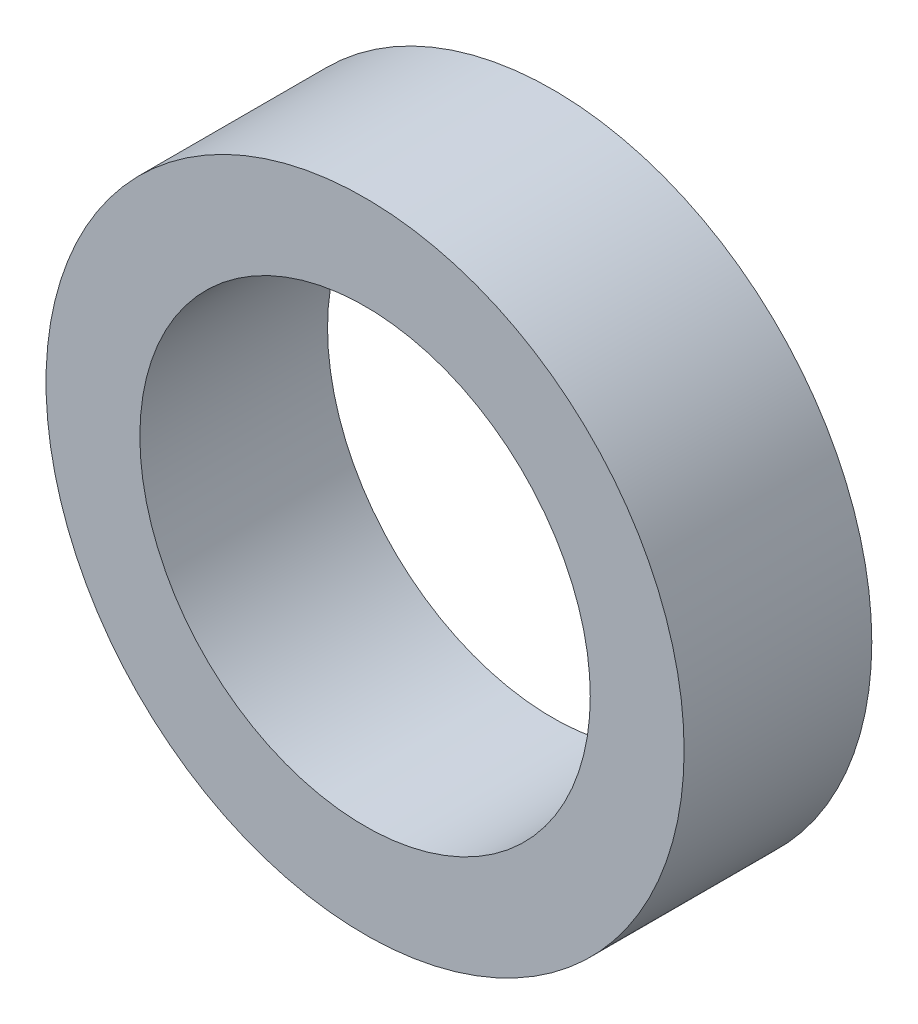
ISO-10303-21;
HEADER;
FILE_DESCRIPTION(('STEP AP214'),'2;1');
FILE_NAME('part.step','',(''),(''),'','','');
FILE_SCHEMA(('AUTOMOTIVE_DESIGN { 1 0 10303 214 1 1 1 1 }'));
ENDSEC;
DATA;
#1=APPLICATION_CONTEXT('core data for automotive mechanical design processes');
#2=APPLICATION_PROTOCOL_DEFINITION('international standard','automotive_design',2000,#1);
#3=PRODUCT_CONTEXT('',#1,'mechanical');
#4=PRODUCT('Part','Part','',(#3));
#5=PRODUCT_RELATED_PRODUCT_CATEGORY('part','',(#4));
#6=PRODUCT_DEFINITION_FORMATION('','',#4);
#7=PRODUCT_DEFINITION_CONTEXT('part definition',#1,'design');
#8=PRODUCT_DEFINITION('design','',#6,#7);
#9=PRODUCT_DEFINITION_SHAPE('','',#8);
#10=(LENGTH_UNIT() NAMED_UNIT(*) SI_UNIT(.MILLI.,.METRE.));
#11=(NAMED_UNIT(*) PLANE_ANGLE_UNIT() SI_UNIT($,.RADIAN.));
#12=(NAMED_UNIT(*) SI_UNIT($,.STERADIAN.) SOLID_ANGLE_UNIT());
#13=UNCERTAINTY_MEASURE_WITH_UNIT(LENGTH_MEASURE(1.E-05),#10,'distance_accuracy_value','');
#14=(GEOMETRIC_REPRESENTATION_CONTEXT(3) GLOBAL_UNCERTAINTY_ASSIGNED_CONTEXT((#13)) GLOBAL_UNIT_ASSIGNED_CONTEXT((#10,
#11,#12)) REPRESENTATION_CONTEXT('',''));
#15=CARTESIAN_POINT('',(0.,0.,0.));
#16=DIRECTION('',(0.,0.,1.));
#17=DIRECTION('',(1.,0.,0.));
#18=AXIS2_PLACEMENT_3D('',#15,#16,#17);
#19=CARTESIAN_POINT('',(0.,0.,5.));
#20=DIRECTION('',(0.,0.,-1.));
#21=DIRECTION('',(0.,1.,0.));
#22=AXIS2_PLACEMENT_3D('',#19,#20,#21);
#23=CYLINDRICAL_SURFACE('',#22,6.);
#24=CARTESIAN_POINT('',(0.,0.,5.));
#25=DIRECTION('',(0.,0.,-1.));
#26=DIRECTION('',(1.,0.,0.));
#27=AXIS2_PLACEMENT_3D('',#24,#25,#26);
#28=CIRCLE('',#27,6.);
#29=CARTESIAN_POINT('',(6.,0.,5.));
#30=VERTEX_POINT('',#29);
#31=EDGE_CURVE('E8',#30,#30,#28,.T.);
#32=ORIENTED_EDGE('',*,*,#31,.F.);
#33=EDGE_LOOP('',(#32));
#34=FACE_BOUND('',#33,.T.);
#35=CARTESIAN_POINT('',(0.,0.,0.));
#36=DIRECTION('',(0.,0.,-1.));
#37=DIRECTION('',(1.,0.,0.));
#38=AXIS2_PLACEMENT_3D('',#35,#36,#37);
#39=CIRCLE('',#38,6.);
#40=CARTESIAN_POINT('',(6.,0.,0.));
#41=VERTEX_POINT('',#40);
#42=EDGE_CURVE('E23',#41,#41,#39,.T.);
#43=ORIENTED_EDGE('',*,*,#42,.T.);
#44=EDGE_LOOP('',(#43));
#45=FACE_BOUND('',#44,.T.);
#46=ADVANCED_FACE('F12',(#34,#45),#23,.F.);
#47=CARTESIAN_POINT('',(0.,0.,5.));
#48=DIRECTION('',(0.,0.,-1.));
#49=DIRECTION('',(0.,1.,0.));
#50=AXIS2_PLACEMENT_3D('',#47,#48,#49);
#51=CYLINDRICAL_SURFACE('',#50,8.5);
#52=CARTESIAN_POINT('',(0.,0.,5.));
#53=DIRECTION('',(0.,0.,-1.));
#54=DIRECTION('',(1.,0.,0.));
#55=AXIS2_PLACEMENT_3D('',#52,#53,#54);
#56=CIRCLE('',#55,8.5);
#57=CARTESIAN_POINT('',(8.5,0.,5.));
#58=VERTEX_POINT('',#57);
#59=EDGE_CURVE('E19',#58,#58,#56,.T.);
#60=ORIENTED_EDGE('',*,*,#59,.T.);
#61=EDGE_LOOP('',(#60));
#62=FACE_BOUND('',#61,.T.);
#63=CARTESIAN_POINT('',(0.,0.,0.));
#64=DIRECTION('',(0.,0.,-1.));
#65=DIRECTION('',(1.,0.,0.));
#66=AXIS2_PLACEMENT_3D('',#63,#64,#65);
#67=CIRCLE('',#66,8.5);
#68=CARTESIAN_POINT('',(8.5,0.,0.));
#69=VERTEX_POINT('',#68);
#70=EDGE_CURVE('E28',#69,#69,#67,.T.);
#71=ORIENTED_EDGE('',*,*,#70,.F.);
#72=EDGE_LOOP('',(#71));
#73=FACE_BOUND('',#72,.T.);
#74=ADVANCED_FACE('F14',(#62,#73),#51,.T.);
#75=CARTESIAN_POINT('',(0.,0.,5.));
#76=DIRECTION('',(0.,0.,-1.));
#77=DIRECTION('',(0.,1.,0.));
#78=AXIS2_PLACEMENT_3D('',#75,#76,#77);
#79=PLANE('',#78);
#80=ORIENTED_EDGE('',*,*,#31,.T.);
#81=EDGE_LOOP('',(#80));
#82=FACE_BOUND('',#81,.T.);
#83=ORIENTED_EDGE('',*,*,#59,.F.);
#84=EDGE_LOOP('',(#83));
#85=FACE_BOUND('',#84,.T.);
#86=ADVANCED_FACE('F40',(#82,#85),#79,.F.);
#87=CARTESIAN_POINT('',(0.,0.,0.));
#88=DIRECTION('',(0.,0.,-1.));
#89=DIRECTION('',(0.,1.,0.));
#90=AXIS2_PLACEMENT_3D('',#87,#88,#89);
#91=PLANE('',#90);
#92=ORIENTED_EDGE('',*,*,#42,.F.);
#93=EDGE_LOOP('',(#92));
#94=FACE_BOUND('',#93,.T.);
#95=ORIENTED_EDGE('',*,*,#70,.T.);
#96=EDGE_LOOP('',(#95));
#97=FACE_BOUND('',#96,.T.);
#98=ADVANCED_FACE('F37',(#94,#97),#91,.T.);
#99=CLOSED_SHELL('',(#46,#74,#86,#98));
#100=MANIFOLD_SOLID_BREP('B1',#99);
#101=ADVANCED_BREP_SHAPE_REPRESENTATION('',(#18,#100),#14);
#102=SHAPE_DEFINITION_REPRESENTATION(#9,#101);
ENDSEC;
END-ISO-10303-21;
